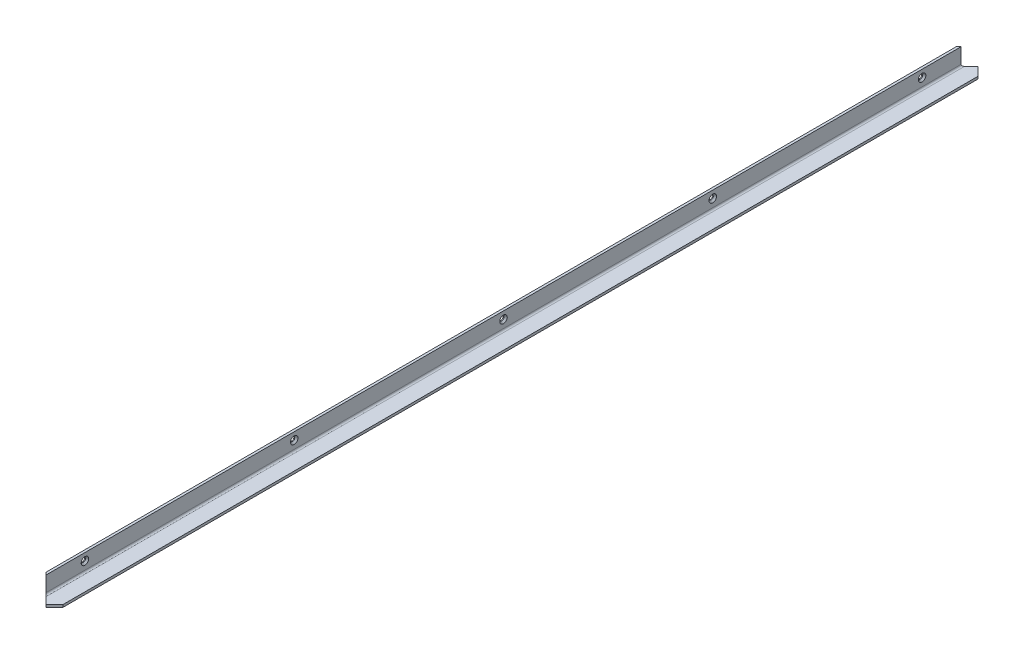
ISO-10303-21;
HEADER;
FILE_DESCRIPTION(('STEP AP214'),'2;1');
FILE_NAME('part.step','',(''),(''),'','','');
FILE_SCHEMA(('AUTOMOTIVE_DESIGN { 1 0 10303 214 1 1 1 1 }'));
ENDSEC;
DATA;
#1=APPLICATION_CONTEXT('core data for automotive mechanical design processes');
#2=APPLICATION_PROTOCOL_DEFINITION('international standard','automotive_design',2000,#1);
#3=PRODUCT_CONTEXT('',#1,'mechanical');
#4=PRODUCT('Part','Part','',(#3));
#5=PRODUCT_RELATED_PRODUCT_CATEGORY('part','',(#4));
#6=PRODUCT_DEFINITION_FORMATION('','',#4);
#7=PRODUCT_DEFINITION_CONTEXT('part definition',#1,'design');
#8=PRODUCT_DEFINITION('design','',#6,#7);
#9=PRODUCT_DEFINITION_SHAPE('','',#8);
#10=(LENGTH_UNIT() NAMED_UNIT(*) SI_UNIT(.MILLI.,.METRE.));
#11=(NAMED_UNIT(*) PLANE_ANGLE_UNIT() SI_UNIT($,.RADIAN.));
#12=(NAMED_UNIT(*) SI_UNIT($,.STERADIAN.) SOLID_ANGLE_UNIT());
#13=UNCERTAINTY_MEASURE_WITH_UNIT(LENGTH_MEASURE(1.E-05),#10,'distance_accuracy_value','');
#14=(GEOMETRIC_REPRESENTATION_CONTEXT(3) GLOBAL_UNCERTAINTY_ASSIGNED_CONTEXT((#13)) GLOBAL_UNIT_ASSIGNED_CONTEXT((#10,
#11,#12)) REPRESENTATION_CONTEXT('',''));
#15=CARTESIAN_POINT('',(0.,0.,0.));
#16=DIRECTION('',(0.,0.,1.));
#17=DIRECTION('',(1.,0.,0.));
#18=AXIS2_PLACEMENT_3D('',#15,#16,#17);
#19=CARTESIAN_POINT('',(0.,0.,2476.5));
#20=DIRECTION('',(0.,1.,0.));
#21=DIRECTION('',(0.,0.,1.));
#22=AXIS2_PLACEMENT_3D('',#19,#20,#21);
#23=PLANE('',#22);
#24=DIRECTION('',(0.,0.,-1.));
#25=VECTOR('',#24,1.);
#26=CARTESIAN_POINT('',(0.,0.,2476.5));
#27=LINE('',#26,#25);
#28=CARTESIAN_POINT('',(0.,0.,2425.7));
#29=VERTEX_POINT('',#28);
#30=CARTESIAN_POINT('',(0.,0.,50.8));
#31=VERTEX_POINT('',#30);
#32=EDGE_CURVE('E277',#29,#31,#27,.T.);
#33=ORIENTED_EDGE('',*,*,#32,.T.);
#34=DIRECTION('',(-0.707106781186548,0.,0.707106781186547));
#35=VECTOR('',#34,1.);
#36=CARTESIAN_POINT('',(28.4957415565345,0.,22.3042584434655));
#37=LINE('',#36,#35);
#38=CARTESIAN_POINT('',(28.4957415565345,0.,22.3042584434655));
#39=VERTEX_POINT('',#38);
#40=EDGE_CURVE('E120',#39,#31,#37,.T.);
#41=ORIENTED_EDGE('',*,*,#40,.F.);
#42=DIRECTION('',(-0.707106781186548,0.,-0.707106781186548));
#43=VECTOR('',#42,1.);
#44=CARTESIAN_POINT('',(50.8,0.,44.608516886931));
#45=LINE('',#44,#43);
#46=CARTESIAN_POINT('',(50.8,0.,44.608516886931));
#47=VERTEX_POINT('',#46);
#48=EDGE_CURVE('E104',#47,#39,#45,.T.);
#49=ORIENTED_EDGE('',*,*,#48,.F.);
#50=DIRECTION('',(0.,0.,-1.));
#51=VECTOR('',#50,1.);
#52=CARTESIAN_POINT('',(50.8,0.,2476.5));
#53=LINE('',#52,#51);
#54=CARTESIAN_POINT('',(50.8,0.,2431.89148311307));
#55=VERTEX_POINT('',#54);
#56=EDGE_CURVE('E119',#55,#47,#53,.T.);
#57=ORIENTED_EDGE('',*,*,#56,.F.);
#58=DIRECTION('',(0.707106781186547,0.,-0.707106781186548));
#59=VECTOR('',#58,1.);
#60=CARTESIAN_POINT('',(50.8,0.,2431.89148311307));
#61=LINE('',#60,#59);
#62=CARTESIAN_POINT('',(28.4957415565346,0.,2454.19574155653));
#63=VERTEX_POINT('',#62);
#64=EDGE_CURVE('E285',#63,#55,#61,.T.);
#65=ORIENTED_EDGE('',*,*,#64,.F.);
#66=DIRECTION('',(0.707106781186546,0.,0.70710678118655));
#67=VECTOR('',#66,1.);
#68=CARTESIAN_POINT('',(28.4957415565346,0.,2454.19574155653));
#69=LINE('',#68,#67);
#70=EDGE_CURVE('E253',#29,#63,#69,.T.);
#71=ORIENTED_EDGE('',*,*,#70,.F.);
#72=EDGE_LOOP('',(#33,#41,#49,#57,#65,#71));
#73=FACE_BOUND('',#72,.T.);
#74=ADVANCED_FACE('F27',(#73),#23,.F.);
#75=CARTESIAN_POINT('',(50.8,6.35,2476.5));
#76=DIRECTION('',(1.,0.,0.));
#77=DIRECTION('',(0.,0.,-1.));
#78=AXIS2_PLACEMENT_3D('',#75,#76,#77);
#79=PLANE('',#78);
#80=DIRECTION('',(0.,-1.,0.));
#81=VECTOR('',#80,1.);
#82=CARTESIAN_POINT('',(50.8,50.8,44.608516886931));
#83=LINE('',#82,#81);
#84=CARTESIAN_POINT('',(50.8,6.35,44.608516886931));
#85=VERTEX_POINT('',#84);
#86=EDGE_CURVE('E100',#85,#47,#83,.T.);
#87=ORIENTED_EDGE('',*,*,#86,.F.);
#88=DIRECTION('',(0.,0.,-1.));
#89=VECTOR('',#88,1.);
#90=CARTESIAN_POINT('',(50.8,6.35,2476.5));
#91=LINE('',#90,#89);
#92=CARTESIAN_POINT('',(50.8,6.35,2431.89148311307));
#93=VERTEX_POINT('',#92);
#94=EDGE_CURVE('E127',#93,#85,#91,.T.);
#95=ORIENTED_EDGE('',*,*,#94,.F.);
#96=DIRECTION('',(0.,-1.,0.));
#97=VECTOR('',#96,1.);
#98=CARTESIAN_POINT('',(50.8,50.8,2431.89148311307));
#99=LINE('',#98,#97);
#100=EDGE_CURVE('E125',#93,#55,#99,.T.);
#101=ORIENTED_EDGE('',*,*,#100,.T.);
#102=ORIENTED_EDGE('',*,*,#56,.T.);
#103=EDGE_LOOP('',(#87,#95,#101,#102));
#104=FACE_BOUND('',#103,.T.);
#105=ADVANCED_FACE('F124',(#104),#79,.T.);
#106=CARTESIAN_POINT('',(0.,6.35,2476.5));
#107=DIRECTION('',(0.,1.,0.));
#108=DIRECTION('',(0.,0.,1.));
#109=AXIS2_PLACEMENT_3D('',#106,#107,#108);
#110=PLANE('',#109);
#111=DIRECTION('',(0.707106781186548,0.,-0.707106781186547));
#112=VECTOR('',#111,1.);
#113=CARTESIAN_POINT('',(-1212.85,6.35,1263.65));
#114=LINE('',#113,#112);
#115=CARTESIAN_POINT('',(10.922,6.35,39.8779999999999));
#116=VERTEX_POINT('',#115);
#117=CARTESIAN_POINT('',(28.4957415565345,6.35,22.3042584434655));
#118=VERTEX_POINT('',#117);
#119=EDGE_CURVE('E252',#116,#118,#114,.T.);
#120=ORIENTED_EDGE('',*,*,#119,.F.);
#121=DIRECTION('',(0.,0.,-1.));
#122=VECTOR('',#121,1.);
#123=CARTESIAN_POINT('',(10.922,6.35,2476.5));
#124=LINE('',#123,#122);
#125=CARTESIAN_POINT('',(10.922,6.35,2436.622));
#126=VERTEX_POINT('',#125);
#127=EDGE_CURVE('E50',#116,#126,#124,.F.);
#128=ORIENTED_EDGE('',*,*,#127,.T.);
#129=DIRECTION('',(-0.707106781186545,0.,-0.70710678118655));
#130=VECTOR('',#129,1.);
#131=CARTESIAN_POINT('',(25.4000000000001,6.35,2451.1));
#132=LINE('',#131,#130);
#133=CARTESIAN_POINT('',(28.4957415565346,6.35,2454.19574155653));
#134=VERTEX_POINT('',#133);
#135=EDGE_CURVE('E262',#134,#126,#132,.T.);
#136=ORIENTED_EDGE('',*,*,#135,.F.);
#137=DIRECTION('',(-0.707106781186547,0.,0.707106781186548));
#138=VECTOR('',#137,1.);
#139=CARTESIAN_POINT('',(3.09574155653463,6.35,2479.59574155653));
#140=LINE('',#139,#138);
#141=EDGE_CURVE('E139',#93,#134,#140,.T.);
#142=ORIENTED_EDGE('',*,*,#141,.F.);
#143=ORIENTED_EDGE('',*,*,#94,.T.);
#144=DIRECTION('',(0.707106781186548,0.,0.707106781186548));
#145=VECTOR('',#144,1.);
#146=CARTESIAN_POINT('',(1241.34574155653,6.35,1235.15425844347));
#147=LINE('',#146,#145);
#148=EDGE_CURVE('E107',#118,#85,#147,.T.);
#149=ORIENTED_EDGE('',*,*,#148,.F.);
#150=EDGE_LOOP('',(#120,#128,#136,#142,#143,#149));
#151=FACE_BOUND('',#150,.T.);
#152=ADVANCED_FACE('F203',(#151),#110,.T.);
#153=CARTESIAN_POINT('',(6.35,50.8,2476.5));
#154=DIRECTION('',(1.,0.,0.));
#155=DIRECTION('',(0.,1.,0.));
#156=AXIS2_PLACEMENT_3D('',#153,#154,#155);
#157=PLANE('',#156);
#158=CARTESIAN_POINT('',(6.35,31.75,2330.45));
#159=DIRECTION('',(1.,0.,0.));
#160=DIRECTION('',(0.,1.,0.));
#161=AXIS2_PLACEMENT_3D('',#158,#159,#160);
#162=CIRCLE('',#161,9.7789999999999);
#163=CARTESIAN_POINT('',(6.35,41.5289999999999,2330.45));
#164=VERTEX_POINT('',#163);
#165=EDGE_CURVE('E168',#164,#164,#162,.F.);
#166=ORIENTED_EDGE('',*,*,#165,.T.);
#167=EDGE_LOOP('',(#166));
#168=FACE_BOUND('',#167,.T.);
#169=CARTESIAN_POINT('',(6.35,31.75,1784.35));
#170=DIRECTION('',(1.,0.,0.));
#171=DIRECTION('',(0.,1.,0.));
#172=AXIS2_PLACEMENT_3D('',#169,#170,#171);
#173=CIRCLE('',#172,9.7789999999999);
#174=CARTESIAN_POINT('',(6.35,41.5289999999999,1784.35));
#175=VERTEX_POINT('',#174);
#176=EDGE_CURVE('E165',#175,#175,#173,.F.);
#177=ORIENTED_EDGE('',*,*,#176,.T.);
#178=EDGE_LOOP('',(#177));
#179=FACE_BOUND('',#178,.T.);
#180=CARTESIAN_POINT('',(6.35,31.75,1238.25));
#181=DIRECTION('',(1.,0.,0.));
#182=DIRECTION('',(0.,1.,0.));
#183=AXIS2_PLACEMENT_3D('',#180,#181,#182);
#184=CIRCLE('',#183,9.7789999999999);
#185=CARTESIAN_POINT('',(6.35,41.5289999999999,1238.25));
#186=VERTEX_POINT('',#185);
#187=EDGE_CURVE('E162',#186,#186,#184,.F.);
#188=ORIENTED_EDGE('',*,*,#187,.T.);
#189=EDGE_LOOP('',(#188));
#190=FACE_BOUND('',#189,.T.);
#191=CARTESIAN_POINT('',(6.35,31.75,692.15));
#192=DIRECTION('',(1.,0.,0.));
#193=DIRECTION('',(0.,1.,0.));
#194=AXIS2_PLACEMENT_3D('',#191,#192,#193);
#195=CIRCLE('',#194,9.7789999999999);
#196=CARTESIAN_POINT('',(6.35,41.5289999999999,692.15));
#197=VERTEX_POINT('',#196);
#198=EDGE_CURVE('E159',#197,#197,#195,.F.);
#199=ORIENTED_EDGE('',*,*,#198,.T.);
#200=EDGE_LOOP('',(#199));
#201=FACE_BOUND('',#200,.T.);
#202=CARTESIAN_POINT('',(6.35,31.75,146.05));
#203=DIRECTION('',(1.,0.,0.));
#204=DIRECTION('',(0.,1.,0.));
#205=AXIS2_PLACEMENT_3D('',#202,#203,#204);
#206=CIRCLE('',#205,9.7789999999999);
#207=CARTESIAN_POINT('',(6.35,41.5289999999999,146.05));
#208=VERTEX_POINT('',#207);
#209=EDGE_CURVE('E156',#208,#208,#206,.F.);
#210=ORIENTED_EDGE('',*,*,#209,.T.);
#211=EDGE_LOOP('',(#210));
#212=FACE_BOUND('',#211,.T.);
#213=DIRECTION('',(0.,-1.,0.));
#214=VECTOR('',#213,1.);
#215=CARTESIAN_POINT('',(6.35,50.8000000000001,44.4499999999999));
#216=LINE('',#215,#214);
#217=CARTESIAN_POINT('',(6.3500000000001,50.8,44.4499999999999));
#218=VERTEX_POINT('',#217);
#219=CARTESIAN_POINT('',(6.35,10.922,44.4499999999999));
#220=VERTEX_POINT('',#219);
#221=EDGE_CURVE('E42',#218,#220,#216,.T.);
#222=ORIENTED_EDGE('',*,*,#221,.F.);
#223=DIRECTION('',(0.,0.,-1.));
#224=VECTOR('',#223,1.);
#225=CARTESIAN_POINT('',(6.35,50.8,2476.5));
#226=LINE('',#225,#224);
#227=CARTESIAN_POINT('',(6.35000000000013,50.8,2432.05));
#228=VERTEX_POINT('',#227);
#229=EDGE_CURVE('E131',#228,#218,#226,.T.);
#230=ORIENTED_EDGE('',*,*,#229,.F.);
#231=DIRECTION('',(0.,1.,0.));
#232=VECTOR('',#231,1.);
#233=CARTESIAN_POINT('',(6.35,50.8,2432.05));
#234=LINE('',#233,#232);
#235=CARTESIAN_POINT('',(6.35,10.922,2432.05));
#236=VERTEX_POINT('',#235);
#237=EDGE_CURVE('E259',#236,#228,#234,.T.);
#238=ORIENTED_EDGE('',*,*,#237,.F.);
#239=DIRECTION('',(0.,0.,-1.));
#240=VECTOR('',#239,1.);
#241=CARTESIAN_POINT('',(6.35,10.922,0.));
#242=LINE('',#241,#240);
#243=EDGE_CURVE('E126',#236,#220,#242,.T.);
#244=ORIENTED_EDGE('',*,*,#243,.T.);
#245=EDGE_LOOP('',(#222,#230,#238,#244));
#246=FACE_BOUND('',#245,.T.);
#247=ADVANCED_FACE('F241',(#168,#179,#190,#201,#212,#246),#157,.T.);
#248=CARTESIAN_POINT('',(0.,50.8,2476.5));
#249=DIRECTION('',(0.,1.,0.));
#250=DIRECTION('',(0.,0.,1.));
#251=AXIS2_PLACEMENT_3D('',#248,#249,#250);
#252=PLANE('',#251);
#253=DIRECTION('',(-0.707106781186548,0.,0.707106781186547));
#254=VECTOR('',#253,1.);
#255=CARTESIAN_POINT('',(28.4957415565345,50.8,22.3042584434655));
#256=LINE('',#255,#254);
#257=CARTESIAN_POINT('',(0.,50.8,50.8));
#258=VERTEX_POINT('',#257);
#259=EDGE_CURVE('E113',#218,#258,#256,.T.);
#260=ORIENTED_EDGE('',*,*,#259,.T.);
#261=DIRECTION('',(0.,0.,-1.));
#262=VECTOR('',#261,1.);
#263=CARTESIAN_POINT('',(0.,50.8,2476.5));
#264=LINE('',#263,#262);
#265=CARTESIAN_POINT('',(0.,50.8,2425.7));
#266=VERTEX_POINT('',#265);
#267=EDGE_CURVE('E279',#266,#258,#264,.T.);
#268=ORIENTED_EDGE('',*,*,#267,.F.);
#269=DIRECTION('',(0.707106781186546,0.,0.70710678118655));
#270=VECTOR('',#269,1.);
#271=CARTESIAN_POINT('',(28.4957415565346,50.8,2454.19574155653));
#272=LINE('',#271,#270);
#273=EDGE_CURVE('E283',#266,#228,#272,.T.);
#274=ORIENTED_EDGE('',*,*,#273,.T.);
#275=ORIENTED_EDGE('',*,*,#229,.T.);
#276=EDGE_LOOP('',(#260,#268,#274,#275));
#277=FACE_BOUND('',#276,.T.);
#278=ADVANCED_FACE('F229',(#277),#252,.T.);
#279=CARTESIAN_POINT('',(0.,50.8,2476.5));
#280=DIRECTION('',(1.,0.,0.));
#281=DIRECTION('',(0.,1.,0.));
#282=AXIS2_PLACEMENT_3D('',#279,#280,#281);
#283=PLANE('',#282);
#284=CARTESIAN_POINT('',(0.,31.75,1784.35));
#285=DIRECTION('',(-1.,0.,0.));
#286=DIRECTION('',(0.,-1.,0.));
#287=AXIS2_PLACEMENT_3D('',#284,#285,#286);
#288=CIRCLE('',#287,5.20699999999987);
#289=CARTESIAN_POINT('',(0.,26.5430000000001,1784.35));
#290=VERTEX_POINT('',#289);
#291=EDGE_CURVE('E121',#290,#290,#288,.T.);
#292=ORIENTED_EDGE('',*,*,#291,.F.);
#293=EDGE_LOOP('',(#292));
#294=FACE_BOUND('',#293,.T.);
#295=CARTESIAN_POINT('',(0.,31.75,2330.45));
#296=DIRECTION('',(-1.,0.,0.));
#297=DIRECTION('',(0.,-1.,0.));
#298=AXIS2_PLACEMENT_3D('',#295,#296,#297);
#299=CIRCLE('',#298,5.20699999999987);
#300=CARTESIAN_POINT('',(0.,26.5430000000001,2330.45));
#301=VERTEX_POINT('',#300);
#302=EDGE_CURVE('E267',#301,#301,#299,.T.);
#303=ORIENTED_EDGE('',*,*,#302,.F.);
#304=EDGE_LOOP('',(#303));
#305=FACE_BOUND('',#304,.T.);
#306=ORIENTED_EDGE('',*,*,#267,.T.);
#307=DIRECTION('',(0.,-1.,0.));
#308=VECTOR('',#307,1.);
#309=CARTESIAN_POINT('',(0.,50.8,50.8));
#310=LINE('',#309,#308);
#311=EDGE_CURVE('E296',#258,#31,#310,.T.);
#312=ORIENTED_EDGE('',*,*,#311,.T.);
#313=ORIENTED_EDGE('',*,*,#32,.F.);
#314=DIRECTION('',(0.,-1.,0.));
#315=VECTOR('',#314,1.);
#316=CARTESIAN_POINT('',(0.,50.8,2425.7));
#317=LINE('',#316,#315);
#318=EDGE_CURVE('E272',#266,#29,#317,.T.);
#319=ORIENTED_EDGE('',*,*,#318,.F.);
#320=EDGE_LOOP('',(#306,#312,#313,#319));
#321=FACE_BOUND('',#320,.T.);
#322=CARTESIAN_POINT('',(0.,31.75,1238.25));
#323=DIRECTION('',(-1.,0.,0.));
#324=DIRECTION('',(0.,-1.,0.));
#325=AXIS2_PLACEMENT_3D('',#322,#323,#324);
#326=CIRCLE('',#325,5.20699999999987);
#327=CARTESIAN_POINT('',(0.,26.5430000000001,1238.25));
#328=VERTEX_POINT('',#327);
#329=EDGE_CURVE('E144',#328,#328,#326,.T.);
#330=ORIENTED_EDGE('',*,*,#329,.F.);
#331=EDGE_LOOP('',(#330));
#332=FACE_BOUND('',#331,.T.);
#333=CARTESIAN_POINT('',(0.,31.75,692.15));
#334=DIRECTION('',(-1.,0.,0.));
#335=DIRECTION('',(0.,-1.,0.));
#336=AXIS2_PLACEMENT_3D('',#333,#334,#335);
#337=CIRCLE('',#336,5.20699999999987);
#338=CARTESIAN_POINT('',(0.,26.5430000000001,692.15));
#339=VERTEX_POINT('',#338);
#340=EDGE_CURVE('E147',#339,#339,#337,.T.);
#341=ORIENTED_EDGE('',*,*,#340,.F.);
#342=EDGE_LOOP('',(#341));
#343=FACE_BOUND('',#342,.T.);
#344=CARTESIAN_POINT('',(0.,31.75,146.05));
#345=DIRECTION('',(-1.,0.,0.));
#346=DIRECTION('',(0.,-1.,0.));
#347=AXIS2_PLACEMENT_3D('',#344,#345,#346);
#348=CIRCLE('',#347,5.20699999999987);
#349=CARTESIAN_POINT('',(0.,26.5430000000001,146.05));
#350=VERTEX_POINT('',#349);
#351=EDGE_CURVE('E150',#350,#350,#348,.T.);
#352=ORIENTED_EDGE('',*,*,#351,.F.);
#353=EDGE_LOOP('',(#352));
#354=FACE_BOUND('',#353,.T.);
#355=ADVANCED_FACE('F226',(#294,#305,#321,#332,#343,#354),#283,.F.);
#356=CARTESIAN_POINT('',(10.922,10.922,2476.5));
#357=DIRECTION('',(0.,0.,1.));
#358=DIRECTION('',(1.,0.,0.));
#359=AXIS2_PLACEMENT_3D('',#356,#357,#358);
#360=CYLINDRICAL_SURFACE('',#359,4.572);
#361=ORIENTED_EDGE('',*,*,#127,.F.);
#362=CARTESIAN_POINT('',(10.922,10.922,39.8779999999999));
#363=DIRECTION('',(0.707106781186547,0.,0.707106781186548));
#364=DIRECTION('',(-0.707106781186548,0.,0.707106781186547));
#365=AXIS2_PLACEMENT_3D('',#362,#363,#364);
#366=ELLIPSE('',#365,6.46578440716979,4.572);
#367=EDGE_CURVE('E141',#116,#220,#366,.F.);
#368=ORIENTED_EDGE('',*,*,#367,.T.);
#369=ORIENTED_EDGE('',*,*,#243,.F.);
#370=CARTESIAN_POINT('',(10.922,10.922,2436.622));
#371=DIRECTION('',(0.707106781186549,0.,-0.707106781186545));
#372=DIRECTION('',(0.707106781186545,0.,0.70710678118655));
#373=AXIS2_PLACEMENT_3D('',#370,#371,#372);
#374=ELLIPSE('',#373,6.46578440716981,4.572);
#375=EDGE_CURVE('E136',#236,#126,#374,.F.);
#376=ORIENTED_EDGE('',*,*,#375,.T.);
#377=EDGE_LOOP('',(#361,#368,#369,#376));
#378=FACE_BOUND('',#377,.T.);
#379=ADVANCED_FACE('F228',(#378),#360,.F.);
#380=CARTESIAN_POINT('',(50.8,31.75,2330.45));
#381=DIRECTION('',(-1.,0.,0.));
#382=DIRECTION('',(0.,-1.,0.));
#383=AXIS2_PLACEMENT_3D('',#380,#381,#382);
#384=CYLINDRICAL_SURFACE('',#383,5.20699999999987);
#385=CARTESIAN_POINT('',(2.37562103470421,31.75,2330.45));
#386=DIRECTION('',(1.,0.,0.));
#387=DIRECTION('',(0.,0.,-1.));
#388=AXIS2_PLACEMENT_3D('',#385,#386,#387);
#389=CIRCLE('',#388,5.20699999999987);
#390=CARTESIAN_POINT('',(2.37562103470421,31.75,2325.243));
#391=VERTEX_POINT('',#390);
#392=EDGE_CURVE('E153',#391,#391,#389,.T.);
#393=ORIENTED_EDGE('',*,*,#392,.T.);
#394=EDGE_LOOP('',(#393));
#395=FACE_BOUND('',#394,.T.);
#396=ORIENTED_EDGE('',*,*,#302,.T.);
#397=EDGE_LOOP('',(#396));
#398=FACE_BOUND('',#397,.T.);
#399=ADVANCED_FACE('F237',(#395,#398),#384,.F.);
#400=CARTESIAN_POINT('',(50.8,50.8,2431.89148311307));
#401=DIRECTION('',(-0.707106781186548,0.,-0.707106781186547));
#402=DIRECTION('',(-0.707106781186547,0.,0.707106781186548));
#403=AXIS2_PLACEMENT_3D('',#400,#401,#402);
#404=PLANE('',#403);
#405=ORIENTED_EDGE('',*,*,#141,.T.);
#406=DIRECTION('',(0.,-1.,0.));
#407=VECTOR('',#406,1.);
#408=CARTESIAN_POINT('',(28.4957415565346,50.8,2454.19574155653));
#409=LINE('',#408,#407);
#410=EDGE_CURVE('E269',#134,#63,#409,.T.);
#411=ORIENTED_EDGE('',*,*,#410,.T.);
#412=ORIENTED_EDGE('',*,*,#64,.T.);
#413=ORIENTED_EDGE('',*,*,#100,.F.);
#414=EDGE_LOOP('',(#405,#411,#412,#413));
#415=FACE_BOUND('',#414,.T.);
#416=ADVANCED_FACE('F291',(#415),#404,.F.);
#417=CARTESIAN_POINT('',(28.4957415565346,50.8,2454.19574155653));
#418=DIRECTION('',(0.707106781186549,0.,-0.707106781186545));
#419=DIRECTION('',(-0.707106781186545,0.,-0.70710678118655));
#420=AXIS2_PLACEMENT_3D('',#417,#418,#419);
#421=PLANE('',#420);
#422=ORIENTED_EDGE('',*,*,#135,.T.);
#423=ORIENTED_EDGE('',*,*,#375,.F.);
#424=ORIENTED_EDGE('',*,*,#237,.T.);
#425=ORIENTED_EDGE('',*,*,#273,.F.);
#426=ORIENTED_EDGE('',*,*,#318,.T.);
#427=ORIENTED_EDGE('',*,*,#70,.T.);
#428=ORIENTED_EDGE('',*,*,#410,.F.);
#429=EDGE_LOOP('',(#422,#423,#424,#425,#426,#427,#428));
#430=FACE_BOUND('',#429,.T.);
#431=ADVANCED_FACE('F258',(#430),#421,.F.);
#432=CARTESIAN_POINT('',(28.4957415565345,50.8,22.3042584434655));
#433=DIRECTION('',(0.707106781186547,0.,0.707106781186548));
#434=DIRECTION('',(0.707106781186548,0.,-0.707106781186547));
#435=AXIS2_PLACEMENT_3D('',#432,#433,#434);
#436=PLANE('',#435);
#437=ORIENTED_EDGE('',*,*,#119,.T.);
#438=DIRECTION('',(0.,-1.,0.));
#439=VECTOR('',#438,1.);
#440=CARTESIAN_POINT('',(28.4957415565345,50.8,22.3042584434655));
#441=LINE('',#440,#439);
#442=EDGE_CURVE('E112',#118,#39,#441,.T.);
#443=ORIENTED_EDGE('',*,*,#442,.T.);
#444=ORIENTED_EDGE('',*,*,#40,.T.);
#445=ORIENTED_EDGE('',*,*,#311,.F.);
#446=ORIENTED_EDGE('',*,*,#259,.F.);
#447=ORIENTED_EDGE('',*,*,#221,.T.);
#448=ORIENTED_EDGE('',*,*,#367,.F.);
#449=EDGE_LOOP('',(#437,#443,#444,#445,#446,#447,#448));
#450=FACE_BOUND('',#449,.T.);
#451=ADVANCED_FACE('F311',(#450),#436,.F.);
#452=CARTESIAN_POINT('',(50.8,50.8,44.608516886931));
#453=DIRECTION('',(-0.707106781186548,0.,0.707106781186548));
#454=DIRECTION('',(0.707106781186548,0.,0.707106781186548));
#455=AXIS2_PLACEMENT_3D('',#452,#453,#454);
#456=PLANE('',#455);
#457=ORIENTED_EDGE('',*,*,#148,.T.);
#458=ORIENTED_EDGE('',*,*,#86,.T.);
#459=ORIENTED_EDGE('',*,*,#48,.T.);
#460=ORIENTED_EDGE('',*,*,#442,.F.);
#461=EDGE_LOOP('',(#457,#458,#459,#460));
#462=FACE_BOUND('',#461,.T.);
#463=ADVANCED_FACE('F102',(#462),#456,.F.);
#464=CARTESIAN_POINT('',(50.8,31.75,1784.35));
#465=DIRECTION('',(-1.,0.,0.));
#466=DIRECTION('',(0.,-1.,0.));
#467=AXIS2_PLACEMENT_3D('',#464,#465,#466);
#468=CYLINDRICAL_SURFACE('',#467,5.20699999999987);
#469=CARTESIAN_POINT('',(2.37562103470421,31.75,1784.35));
#470=DIRECTION('',(1.,0.,0.));
#471=DIRECTION('',(0.,0.,-1.));
#472=AXIS2_PLACEMENT_3D('',#469,#470,#471);
#473=CIRCLE('',#472,5.20699999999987);
#474=CARTESIAN_POINT('',(2.37562103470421,31.75,1779.143));
#475=VERTEX_POINT('',#474);
#476=EDGE_CURVE('E171',#475,#475,#473,.T.);
#477=ORIENTED_EDGE('',*,*,#476,.T.);
#478=EDGE_LOOP('',(#477));
#479=FACE_BOUND('',#478,.T.);
#480=ORIENTED_EDGE('',*,*,#291,.T.);
#481=EDGE_LOOP('',(#480));
#482=FACE_BOUND('',#481,.T.);
#483=ADVANCED_FACE('F209',(#479,#482),#468,.F.);
#484=CARTESIAN_POINT('',(50.8,31.75,1238.25));
#485=DIRECTION('',(-1.,0.,0.));
#486=DIRECTION('',(0.,-1.,0.));
#487=AXIS2_PLACEMENT_3D('',#484,#485,#486);
#488=CYLINDRICAL_SURFACE('',#487,5.20699999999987);
#489=CARTESIAN_POINT('',(2.37562103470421,31.75,1238.25));
#490=DIRECTION('',(1.,0.,0.));
#491=DIRECTION('',(0.,0.,-1.));
#492=AXIS2_PLACEMENT_3D('',#489,#490,#491);
#493=CIRCLE('',#492,5.20699999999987);
#494=CARTESIAN_POINT('',(2.37562103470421,31.75,1233.043));
#495=VERTEX_POINT('',#494);
#496=EDGE_CURVE('E174',#495,#495,#493,.T.);
#497=ORIENTED_EDGE('',*,*,#496,.T.);
#498=EDGE_LOOP('',(#497));
#499=FACE_BOUND('',#498,.T.);
#500=ORIENTED_EDGE('',*,*,#329,.T.);
#501=EDGE_LOOP('',(#500));
#502=FACE_BOUND('',#501,.T.);
#503=ADVANCED_FACE('F207',(#499,#502),#488,.F.);
#504=CARTESIAN_POINT('',(50.8,31.75,692.15));
#505=DIRECTION('',(-1.,0.,0.));
#506=DIRECTION('',(0.,-1.,0.));
#507=AXIS2_PLACEMENT_3D('',#504,#505,#506);
#508=CYLINDRICAL_SURFACE('',#507,5.20699999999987);
#509=CARTESIAN_POINT('',(2.37562103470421,31.75,692.15));
#510=DIRECTION('',(1.,0.,0.));
#511=DIRECTION('',(0.,0.,-1.));
#512=AXIS2_PLACEMENT_3D('',#509,#510,#511);
#513=CIRCLE('',#512,5.20699999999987);
#514=CARTESIAN_POINT('',(2.37562103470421,31.75,686.943));
#515=VERTEX_POINT('',#514);
#516=EDGE_CURVE('E35',#515,#515,#513,.T.);
#517=ORIENTED_EDGE('',*,*,#516,.T.);
#518=EDGE_LOOP('',(#517));
#519=FACE_BOUND('',#518,.T.);
#520=ORIENTED_EDGE('',*,*,#340,.T.);
#521=EDGE_LOOP('',(#520));
#522=FACE_BOUND('',#521,.T.);
#523=ADVANCED_FACE('F179',(#519,#522),#508,.F.);
#524=CARTESIAN_POINT('',(50.8,31.75,146.05));
#525=DIRECTION('',(-1.,0.,0.));
#526=DIRECTION('',(0.,-1.,0.));
#527=AXIS2_PLACEMENT_3D('',#524,#525,#526);
#528=CYLINDRICAL_SURFACE('',#527,5.20699999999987);
#529=CARTESIAN_POINT('',(2.37562103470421,31.75,146.05));
#530=DIRECTION('',(1.,0.,0.));
#531=DIRECTION('',(0.,0.,-1.));
#532=AXIS2_PLACEMENT_3D('',#529,#530,#531);
#533=CIRCLE('',#532,5.20699999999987);
#534=CARTESIAN_POINT('',(2.37562103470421,31.75,140.843));
#535=VERTEX_POINT('',#534);
#536=EDGE_CURVE('E11',#535,#535,#533,.T.);
#537=ORIENTED_EDGE('',*,*,#536,.T.);
#538=EDGE_LOOP('',(#537));
#539=FACE_BOUND('',#538,.T.);
#540=ORIENTED_EDGE('',*,*,#351,.T.);
#541=EDGE_LOOP('',(#540));
#542=FACE_BOUND('',#541,.T.);
#543=ADVANCED_FACE('F29',(#539,#542),#528,.F.);
#544=CARTESIAN_POINT('',(2.37562103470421,31.75,2330.45));
#545=DIRECTION('',(1.,0.,0.));
#546=DIRECTION('',(0.,0.,-1.));
#547=AXIS2_PLACEMENT_3D('',#544,#545,#546);
#548=CONICAL_SURFACE('',#547,5.20699999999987,0.855211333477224);
#549=ORIENTED_EDGE('',*,*,#165,.F.);
#550=EDGE_LOOP('',(#549));
#551=FACE_BOUND('',#550,.T.);
#552=ORIENTED_EDGE('',*,*,#392,.F.);
#553=EDGE_LOOP('',(#552));
#554=FACE_BOUND('',#553,.T.);
#555=ADVANCED_FACE('F215',(#551,#554),#548,.F.);
#556=CARTESIAN_POINT('',(2.37562103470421,31.75,1784.35));
#557=DIRECTION('',(1.,0.,0.));
#558=DIRECTION('',(0.,0.,-1.));
#559=AXIS2_PLACEMENT_3D('',#556,#557,#558);
#560=CONICAL_SURFACE('',#559,5.20699999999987,0.855211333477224);
#561=ORIENTED_EDGE('',*,*,#176,.F.);
#562=EDGE_LOOP('',(#561));
#563=FACE_BOUND('',#562,.T.);
#564=ORIENTED_EDGE('',*,*,#476,.F.);
#565=EDGE_LOOP('',(#564));
#566=FACE_BOUND('',#565,.T.);
#567=ADVANCED_FACE('F194',(#563,#566),#560,.F.);
#568=CARTESIAN_POINT('',(2.37562103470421,31.75,1238.25));
#569=DIRECTION('',(1.,0.,0.));
#570=DIRECTION('',(0.,0.,-1.));
#571=AXIS2_PLACEMENT_3D('',#568,#569,#570);
#572=CONICAL_SURFACE('',#571,5.20699999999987,0.855211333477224);
#573=ORIENTED_EDGE('',*,*,#187,.F.);
#574=EDGE_LOOP('',(#573));
#575=FACE_BOUND('',#574,.T.);
#576=ORIENTED_EDGE('',*,*,#496,.F.);
#577=EDGE_LOOP('',(#576));
#578=FACE_BOUND('',#577,.T.);
#579=ADVANCED_FACE('F185',(#575,#578),#572,.F.);
#580=CARTESIAN_POINT('',(2.37562103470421,31.75,692.15));
#581=DIRECTION('',(1.,0.,0.));
#582=DIRECTION('',(0.,0.,-1.));
#583=AXIS2_PLACEMENT_3D('',#580,#581,#582);
#584=CONICAL_SURFACE('',#583,5.20699999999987,0.855211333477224);
#585=ORIENTED_EDGE('',*,*,#198,.F.);
#586=EDGE_LOOP('',(#585));
#587=FACE_BOUND('',#586,.T.);
#588=ORIENTED_EDGE('',*,*,#516,.F.);
#589=EDGE_LOOP('',(#588));
#590=FACE_BOUND('',#589,.T.);
#591=ADVANCED_FACE('F182',(#587,#590),#584,.F.);
#592=CARTESIAN_POINT('',(2.37562103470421,31.75,146.05));
#593=DIRECTION('',(1.,0.,0.));
#594=DIRECTION('',(0.,0.,-1.));
#595=AXIS2_PLACEMENT_3D('',#592,#593,#594);
#596=CONICAL_SURFACE('',#595,5.20699999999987,0.855211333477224);
#597=ORIENTED_EDGE('',*,*,#209,.F.);
#598=EDGE_LOOP('',(#597));
#599=FACE_BOUND('',#598,.T.);
#600=ORIENTED_EDGE('',*,*,#536,.F.);
#601=EDGE_LOOP('',(#600));
#602=FACE_BOUND('',#601,.T.);
#603=ADVANCED_FACE('F184',(#599,#602),#596,.F.);
#604=CLOSED_SHELL('',(#74,#105,#152,#247,#278,#355,#379,#399,#416,#431,#451,#463,#483,#503,#523,
#543,#555,#567,#579,#591,#603));
#605=MANIFOLD_SOLID_BREP('B2',#604);
#606=ADVANCED_BREP_SHAPE_REPRESENTATION('',(#18,#605),#14);
#607=SHAPE_DEFINITION_REPRESENTATION(#9,#606);
ENDSEC;
END-ISO-10303-21;
